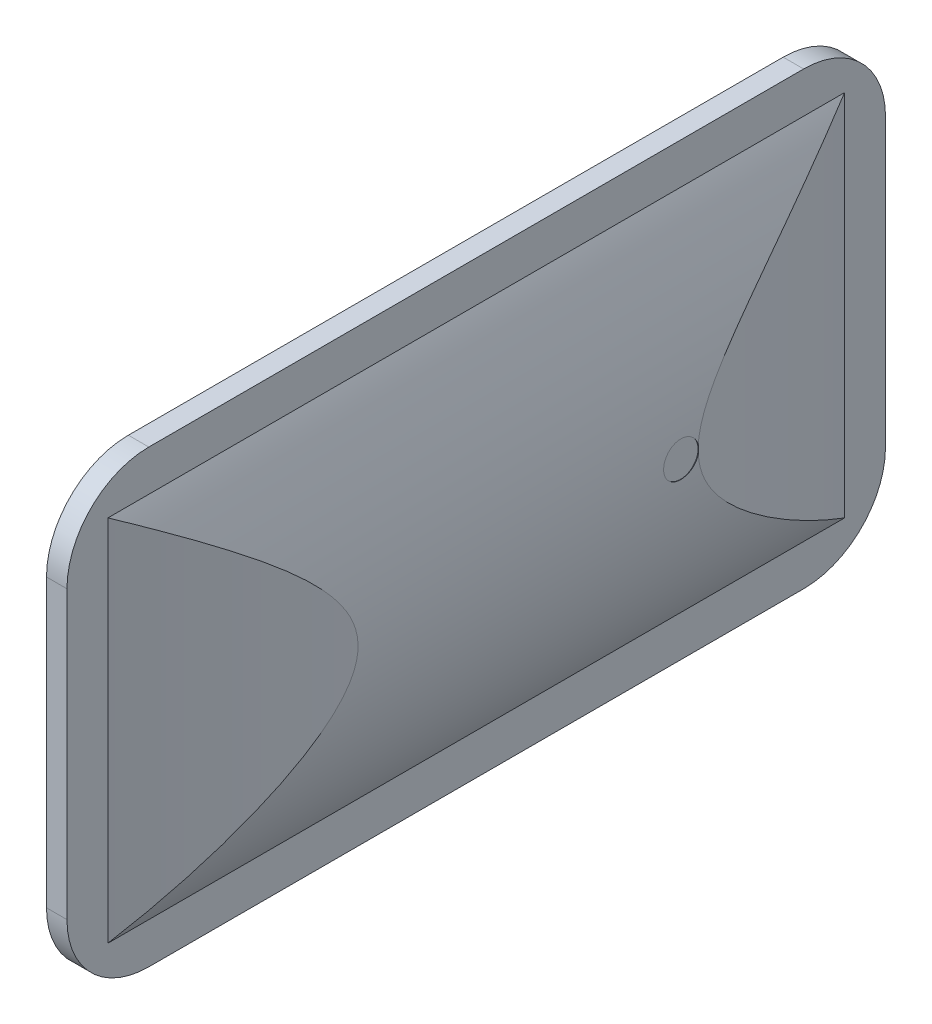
from build123d import *

# Parameters (mm, degrees)
BASE_EXTRUDE_DEPTH  = 254
SKETCH2_OUTSIDE_W   = 99.046
SKETCH2_OUTSIDE_H   = 314.488
CUT_EXTRUDE1_DEPTH  = 291.5232663
CUT_EXTRUDE2_REACH  = 292.751
SKETCH3_R           = 5.461
FILLET1_R           = 25.4
SKETCH4_R           = 5.461
BOSS_EXTRUDE1_DEPTH = 19.05


with BuildPart() as part:
    # Sketch1 → Base-Extrude (new body)
    with BuildSketch(Plane.XY):
        with BuildLine():
            Line((-3.175, 0), (-3.175, 12.7))
            ThreePointArc((-3.175, 12.7), (-19.278959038, 69.85), (-3.175, 127))
            Line((-3.175, 127), (-3.175, 139.7))
            Line((-3.175, 139.7), (3.175, 139.7))
            Line((3.175, 139.7), (3.175, 127))
            ThreePointArc((3.175, 127), (19.278959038, 69.85), (3.175, 12.7))
            Line((3.175, 12.7), (3.175, 0))
            Line((3.175, 0), (-3.175, 0))
        make_face()
    extrude(amount=BASE_EXTRUDE_DEPTH)

    # Sketch2 outside → Cut-Extrude1 (cut, through all)
    with BuildSketch(Plane(origin=(0, 139.7, 0), x_dir=(-1, 0, 0), z_dir=(0, 1, 0))):
        with Locations((0, 127)):
            Rectangle(SKETCH2_OUTSIDE_W, SKETCH2_OUTSIDE_H)
        with BuildLine():
            Line((3.175, 0), (-3.175, 0))
            Line((-3.175, 0), (-3.175, 12.7))
            ThreePointArc((-3.175, 12.7), (-23.506154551, 127), (-3.175, 241.3))
            Line((-3.175, 241.3), (-3.175, 254))
            Line((-3.175, 254), (3.175, 254))
            Line((3.175, 254), (3.175, 241.3))
            ThreePointArc((3.175, 241.3), (23.506154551, 127), (3.175, 12.7))
            Line((3.175, 12.7), (3.175, 0))
        make_face(mode=Mode.SUBTRACT)
    extrude(amount=-CUT_EXTRUDE1_DEPTH, mode=Mode.SUBTRACT)

    # Sketch3 → Cut-Extrude2 (cut, up to next)
    with BuildSketch(Plane(origin=(3.175, 0, 0), x_dir=(0, 0, -1), z_dir=(1, 0, 0)), mode=Mode.PRIVATE) as cut_extrude2_sk1:
        with Locations(Location((-79.497249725, 69.85, 0), (0, 0, 346.521709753))):
            Circle(SKETCH3_R)
    cut_extrude2_tool1 = extrude(cut_extrude2_sk1.sketch, amount=CUT_EXTRUDE2_REACH, mode=Mode.PRIVATE) & part.part
    add(cut_extrude2_tool1.solids().sort_by_distance((3.175, 69.85, 79.49725))[0], mode=Mode.SUBTRACT)

    # Fillet1
    fillet1_edges = [part.edges().sort_by_distance(p)[0] for p in [
        (0, 0, 254),
        (0, 139.7, 254),
        (0, 0, 0),
        (0, 139.7, 0),
    ]]
    fillet(fillet1_edges, radius=FILLET1_R)

    # Sketch4 → Boss-Extrude1 (add)
    with BuildSketch(Plane(origin=(0, 0, 0), x_dir=(0, 0, -1), z_dir=(1, 0, 0))):
        with Locations(Location((-79.497249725, 69.85, 0), (0, 0, 346.521709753))):
            Circle(SKETCH4_R)
    extrude(amount=BOSS_EXTRUDE1_DEPTH)


solid = part.part
